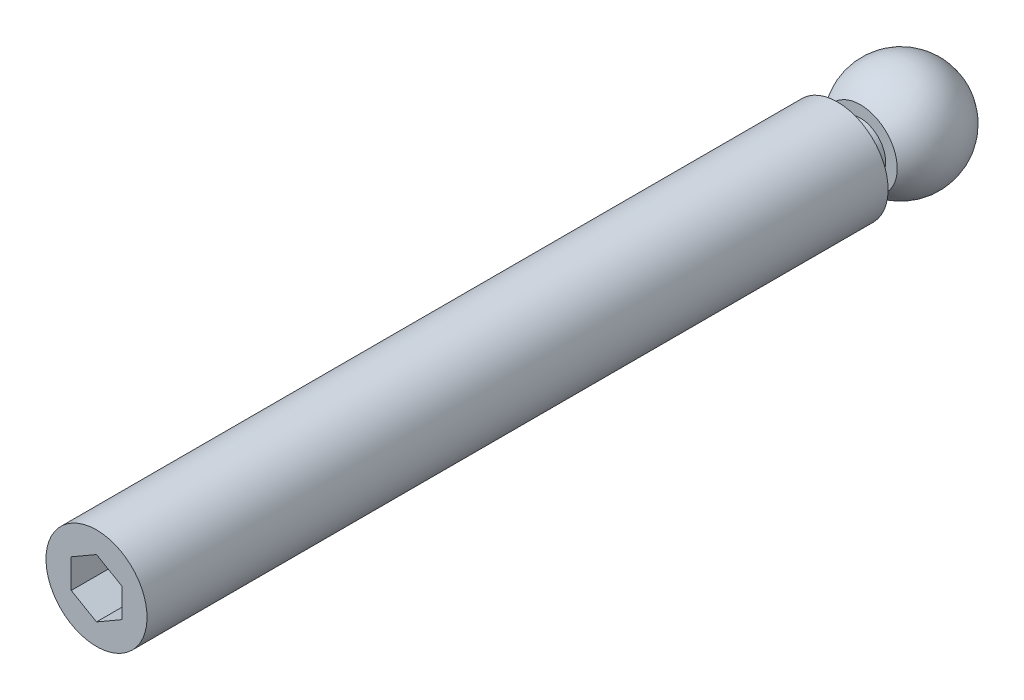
ISO-10303-21;
HEADER;
FILE_DESCRIPTION(('STEP AP214'),'2;1');
FILE_NAME('part.step','',(''),(''),'','','');
FILE_SCHEMA(('AUTOMOTIVE_DESIGN { 1 0 10303 214 1 1 1 1 }'));
ENDSEC;
DATA;
#1=APPLICATION_CONTEXT('core data for automotive mechanical design processes');
#2=APPLICATION_PROTOCOL_DEFINITION('international standard','automotive_design',2000,#1);
#3=PRODUCT_CONTEXT('',#1,'mechanical');
#4=PRODUCT('Part','Part','',(#3));
#5=PRODUCT_RELATED_PRODUCT_CATEGORY('part','',(#4));
#6=PRODUCT_DEFINITION_FORMATION('','',#4);
#7=PRODUCT_DEFINITION_CONTEXT('part definition',#1,'design');
#8=PRODUCT_DEFINITION('design','',#6,#7);
#9=PRODUCT_DEFINITION_SHAPE('','',#8);
#10=(LENGTH_UNIT() NAMED_UNIT(*) SI_UNIT(.MILLI.,.METRE.));
#11=(NAMED_UNIT(*) PLANE_ANGLE_UNIT() SI_UNIT($,.RADIAN.));
#12=(NAMED_UNIT(*) SI_UNIT($,.STERADIAN.) SOLID_ANGLE_UNIT());
#13=UNCERTAINTY_MEASURE_WITH_UNIT(LENGTH_MEASURE(1.E-05),#10,'distance_accuracy_value','');
#14=(GEOMETRIC_REPRESENTATION_CONTEXT(3) GLOBAL_UNCERTAINTY_ASSIGNED_CONTEXT((#13)) GLOBAL_UNIT_ASSIGNED_CONTEXT((#10,
#11,#12)) REPRESENTATION_CONTEXT('',''));
#15=CARTESIAN_POINT('',(0.,0.,0.));
#16=DIRECTION('',(0.,0.,1.));
#17=DIRECTION('',(1.,0.,0.));
#18=AXIS2_PLACEMENT_3D('',#15,#16,#17);
#19=CARTESIAN_POINT('',(0.,0.,6.5));
#20=DIRECTION('',(0.,-1.,0.));
#21=DIRECTION('',(-1.,0.,0.));
#22=AXIS2_PLACEMENT_3D('',#19,#20,#21);
#23=SPHERICAL_SURFACE('',#22,6.5);
#24=CARTESIAN_POINT('',(0.,0.,6.5));
#25=DIRECTION('',(0.,0.,1.));
#26=DIRECTION('',(0.,1.,0.));
#27=AXIS2_PLACEMENT_3D('',#24,#25,#26);
#28=SPHERICAL_SURFACE('',#27,6.5);
#29=CARTESIAN_POINT('',(0.,0.,11.3));
#30=DIRECTION('',(0.,0.,1.));
#31=DIRECTION('',(0.,1.,0.));
#32=AXIS2_PLACEMENT_3D('',#29,#30,#31);
#33=CIRCLE('',#32,4.38292140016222);
#34=CARTESIAN_POINT('',(0.,4.38292140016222,11.3));
#35=VERTEX_POINT('',#34);
#36=EDGE_CURVE('E9',#35,#35,#33,.T.);
#37=ORIENTED_EDGE('',*,*,#36,.F.);
#38=EDGE_LOOP('',(#37));
#39=FACE_BOUND('',#38,.T.);
#40=ADVANCED_FACE('F14',(#39),#28,.T.);
#41=CARTESIAN_POINT('',(0.,-4.38292140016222,11.3));
#42=DIRECTION('',(0.,0.,-1.));
#43=DIRECTION('',(0.,-1.,0.));
#44=AXIS2_PLACEMENT_3D('',#41,#42,#43);
#45=PLANE('',#44);
#46=CARTESIAN_POINT('',(0.,0.,11.3));
#47=DIRECTION('',(0.,0.,1.));
#48=DIRECTION('',(0.,1.,0.));
#49=AXIS2_PLACEMENT_3D('',#46,#47,#48);
#50=CIRCLE('',#49,3.);
#51=CARTESIAN_POINT('',(0.,3.,11.3));
#52=VERTEX_POINT('',#51);
#53=EDGE_CURVE('E21',#52,#52,#50,.T.);
#54=ORIENTED_EDGE('',*,*,#53,.F.);
#55=EDGE_LOOP('',(#54));
#56=FACE_BOUND('',#55,.T.);
#57=ORIENTED_EDGE('',*,*,#36,.T.);
#58=EDGE_LOOP('',(#57));
#59=FACE_BOUND('',#58,.T.);
#60=ADVANCED_FACE('F134',(#56,#59),#45,.F.);
#61=CARTESIAN_POINT('',(0.,0.,8.3));
#62=DIRECTION('',(0.,0.,1.));
#63=DIRECTION('',(0.,1.,0.));
#64=AXIS2_PLACEMENT_3D('',#61,#62,#63);
#65=CYLINDRICAL_SURFACE('',#64,3.);
#66=ORIENTED_EDGE('',*,*,#53,.T.);
#67=EDGE_LOOP('',(#66));
#68=FACE_BOUND('',#67,.T.);
#69=CARTESIAN_POINT('',(0.,0.,14.));
#70=DIRECTION('',(0.,0.,1.));
#71=DIRECTION('',(0.,1.,0.));
#72=AXIS2_PLACEMENT_3D('',#69,#70,#71);
#73=CIRCLE('',#72,3.);
#74=CARTESIAN_POINT('',(0.,3.,14.));
#75=VERTEX_POINT('',#74);
#76=EDGE_CURVE('E126',#75,#75,#73,.T.);
#77=ORIENTED_EDGE('',*,*,#76,.F.);
#78=EDGE_LOOP('',(#77));
#79=FACE_BOUND('',#78,.T.);
#80=ADVANCED_FACE('F131',(#68,#79),#65,.T.);
#81=CARTESIAN_POINT('',(0.,-6.,14.));
#82=DIRECTION('',(0.,0.,-1.));
#83=DIRECTION('',(0.,-1.,0.));
#84=AXIS2_PLACEMENT_3D('',#81,#82,#83);
#85=PLANE('',#84);
#86=ORIENTED_EDGE('',*,*,#76,.T.);
#87=EDGE_LOOP('',(#86));
#88=FACE_BOUND('',#87,.T.);
#89=CARTESIAN_POINT('',(0.,0.,14.));
#90=DIRECTION('',(0.,0.,1.));
#91=DIRECTION('',(0.,1.,0.));
#92=AXIS2_PLACEMENT_3D('',#89,#90,#91);
#93=CIRCLE('',#92,6.);
#94=CARTESIAN_POINT('',(0.,6.,14.));
#95=VERTEX_POINT('',#94);
#96=EDGE_CURVE('E123',#95,#95,#93,.T.);
#97=ORIENTED_EDGE('',*,*,#96,.F.);
#98=EDGE_LOOP('',(#97));
#99=FACE_BOUND('',#98,.T.);
#100=ADVANCED_FACE('F157',(#88,#99),#85,.T.);
#101=CARTESIAN_POINT('',(0.,0.,8.3));
#102=DIRECTION('',(0.,0.,1.));
#103=DIRECTION('',(0.,1.,0.));
#104=AXIS2_PLACEMENT_3D('',#101,#102,#103);
#105=CYLINDRICAL_SURFACE('',#104,6.);
#106=ORIENTED_EDGE('',*,*,#96,.T.);
#107=EDGE_LOOP('',(#106));
#108=FACE_BOUND('',#107,.T.);
#109=CARTESIAN_POINT('',(0.,0.,102.));
#110=DIRECTION('',(0.,0.,1.));
#111=DIRECTION('',(0.,1.,0.));
#112=AXIS2_PLACEMENT_3D('',#109,#110,#111);
#113=CIRCLE('',#112,6.);
#114=CARTESIAN_POINT('',(0.,6.,102.));
#115=VERTEX_POINT('',#114);
#116=EDGE_CURVE('E115',#115,#115,#113,.T.);
#117=ORIENTED_EDGE('',*,*,#116,.F.);
#118=EDGE_LOOP('',(#117));
#119=FACE_BOUND('',#118,.T.);
#120=ADVANCED_FACE('F165',(#108,#119),#105,.T.);
#121=CARTESIAN_POINT('',(0.,0.,102.));
#122=DIRECTION('',(0.,0.,1.));
#123=DIRECTION('',(0.,1.,0.));
#124=AXIS2_PLACEMENT_3D('',#121,#122,#123);
#125=PLANE('',#124);
#126=DIRECTION('',(-0.866025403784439,0.5,0.));
#127=VECTOR('',#126,1.);
#128=CARTESIAN_POINT('',(3.,1.73205080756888,102.));
#129=LINE('',#128,#127);
#130=CARTESIAN_POINT('',(3.,1.73205080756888,102.));
#131=VERTEX_POINT('',#130);
#132=CARTESIAN_POINT('',(0.,3.46410161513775,102.));
#133=VERTEX_POINT('',#132);
#134=EDGE_CURVE('E28',#131,#133,#129,.T.);
#135=ORIENTED_EDGE('',*,*,#134,.F.);
#136=DIRECTION('',(0.,1.,0.));
#137=VECTOR('',#136,1.);
#138=CARTESIAN_POINT('',(3.,-1.73205080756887,102.));
#139=LINE('',#138,#137);
#140=CARTESIAN_POINT('',(3.,-1.73205080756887,102.));
#141=VERTEX_POINT('',#140);
#142=EDGE_CURVE('E111',#141,#131,#139,.T.);
#143=ORIENTED_EDGE('',*,*,#142,.F.);
#144=DIRECTION('',(0.866025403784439,0.5,0.));
#145=VECTOR('',#144,1.);
#146=CARTESIAN_POINT('',(0.,-3.46410161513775,102.));
#147=LINE('',#146,#145);
#148=CARTESIAN_POINT('',(0.,-3.46410161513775,102.));
#149=VERTEX_POINT('',#148);
#150=EDGE_CURVE('E109',#149,#141,#147,.T.);
#151=ORIENTED_EDGE('',*,*,#150,.F.);
#152=DIRECTION('',(0.866025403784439,-0.5,0.));
#153=VECTOR('',#152,1.);
#154=CARTESIAN_POINT('',(-3.,-1.73205080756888,102.));
#155=LINE('',#154,#153);
#156=CARTESIAN_POINT('',(-3.,-1.73205080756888,102.));
#157=VERTEX_POINT('',#156);
#158=EDGE_CURVE('E76',#157,#149,#155,.T.);
#159=ORIENTED_EDGE('',*,*,#158,.F.);
#160=DIRECTION('',(0.,-1.,0.));
#161=VECTOR('',#160,1.);
#162=CARTESIAN_POINT('',(-3.,1.73205080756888,102.));
#163=LINE('',#162,#161);
#164=CARTESIAN_POINT('',(-3.,1.73205080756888,102.));
#165=VERTEX_POINT('',#164);
#166=EDGE_CURVE('E105',#165,#157,#163,.T.);
#167=ORIENTED_EDGE('',*,*,#166,.F.);
#168=DIRECTION('',(-0.866025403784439,-0.5,0.));
#169=VECTOR('',#168,1.);
#170=CARTESIAN_POINT('',(0.,3.46410161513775,102.));
#171=LINE('',#170,#169);
#172=EDGE_CURVE('E102',#133,#165,#171,.T.);
#173=ORIENTED_EDGE('',*,*,#172,.F.);
#174=EDGE_LOOP('',(#135,#143,#151,#159,#167,#173));
#175=FACE_BOUND('',#174,.T.);
#176=ORIENTED_EDGE('',*,*,#116,.T.);
#177=EDGE_LOOP('',(#176));
#178=FACE_BOUND('',#177,.T.);
#179=ADVANCED_FACE('F174',(#175,#178),#125,.T.);
#180=CARTESIAN_POINT('',(3.,1.73205080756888,94.));
#181=DIRECTION('',(0.5,0.866025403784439,0.));
#182=DIRECTION('',(-0.866025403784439,0.5,0.));
#183=AXIS2_PLACEMENT_3D('',#180,#181,#182);
#184=PLANE('',#183);
#185=ORIENTED_EDGE('',*,*,#134,.T.);
#186=DIRECTION('',(0.,0.,1.));
#187=VECTOR('',#186,1.);
#188=CARTESIAN_POINT('',(0.,3.46410161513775,94.));
#189=LINE('',#188,#187);
#190=CARTESIAN_POINT('',(0.,3.46410161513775,94.));
#191=VERTEX_POINT('',#190);
#192=EDGE_CURVE('E58',#191,#133,#189,.T.);
#193=ORIENTED_EDGE('',*,*,#192,.F.);
#194=DIRECTION('',(-0.866025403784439,0.5,0.));
#195=VECTOR('',#194,1.);
#196=CARTESIAN_POINT('',(3.,1.73205080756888,94.));
#197=LINE('',#196,#195);
#198=CARTESIAN_POINT('',(3.,1.73205080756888,94.));
#199=VERTEX_POINT('',#198);
#200=EDGE_CURVE('E113',#199,#191,#197,.T.);
#201=ORIENTED_EDGE('',*,*,#200,.F.);
#202=DIRECTION('',(0.,0.,1.));
#203=VECTOR('',#202,1.);
#204=CARTESIAN_POINT('',(3.,1.73205080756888,94.));
#205=LINE('',#204,#203);
#206=EDGE_CURVE('E36',#199,#131,#205,.T.);
#207=ORIENTED_EDGE('',*,*,#206,.T.);
#208=EDGE_LOOP('',(#185,#193,#201,#207));
#209=FACE_BOUND('',#208,.T.);
#210=ADVANCED_FACE('F183',(#209),#184,.F.);
#211=CARTESIAN_POINT('',(3.,-1.73205080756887,94.));
#212=DIRECTION('',(1.,0.,0.));
#213=DIRECTION('',(0.,1.,0.));
#214=AXIS2_PLACEMENT_3D('',#211,#212,#213);
#215=PLANE('',#214);
#216=ORIENTED_EDGE('',*,*,#142,.T.);
#217=ORIENTED_EDGE('',*,*,#206,.F.);
#218=DIRECTION('',(0.,1.,0.));
#219=VECTOR('',#218,1.);
#220=CARTESIAN_POINT('',(3.,-1.73205080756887,94.));
#221=LINE('',#220,#219);
#222=CARTESIAN_POINT('',(3.,-1.73205080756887,94.));
#223=VERTEX_POINT('',#222);
#224=EDGE_CURVE('E88',#223,#199,#221,.T.);
#225=ORIENTED_EDGE('',*,*,#224,.F.);
#226=DIRECTION('',(0.,0.,1.));
#227=VECTOR('',#226,1.);
#228=CARTESIAN_POINT('',(3.,-1.73205080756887,94.));
#229=LINE('',#228,#227);
#230=EDGE_CURVE('E80',#223,#141,#229,.T.);
#231=ORIENTED_EDGE('',*,*,#230,.T.);
#232=EDGE_LOOP('',(#216,#217,#225,#231));
#233=FACE_BOUND('',#232,.T.);
#234=ADVANCED_FACE('F192',(#233),#215,.F.);
#235=CARTESIAN_POINT('',(0.,-3.46410161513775,94.));
#236=DIRECTION('',(0.5,-0.866025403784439,0.));
#237=DIRECTION('',(0.866025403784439,0.5,0.));
#238=AXIS2_PLACEMENT_3D('',#235,#236,#237);
#239=PLANE('',#238);
#240=ORIENTED_EDGE('',*,*,#150,.T.);
#241=ORIENTED_EDGE('',*,*,#230,.F.);
#242=DIRECTION('',(0.866025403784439,0.5,0.));
#243=VECTOR('',#242,1.);
#244=CARTESIAN_POINT('',(0.,-3.46410161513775,94.));
#245=LINE('',#244,#243);
#246=CARTESIAN_POINT('',(0.,-3.46410161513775,94.));
#247=VERTEX_POINT('',#246);
#248=EDGE_CURVE('E84',#247,#223,#245,.T.);
#249=ORIENTED_EDGE('',*,*,#248,.F.);
#250=DIRECTION('',(0.,0.,1.));
#251=VECTOR('',#250,1.);
#252=CARTESIAN_POINT('',(0.,-3.46410161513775,94.));
#253=LINE('',#252,#251);
#254=EDGE_CURVE('E69',#247,#149,#253,.T.);
#255=ORIENTED_EDGE('',*,*,#254,.T.);
#256=EDGE_LOOP('',(#240,#241,#249,#255));
#257=FACE_BOUND('',#256,.T.);
#258=ADVANCED_FACE('F85',(#257),#239,.F.);
#259=CARTESIAN_POINT('',(-3.,-1.73205080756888,94.));
#260=DIRECTION('',(-0.5,-0.866025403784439,0.));
#261=DIRECTION('',(0.866025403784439,-0.5,0.));
#262=AXIS2_PLACEMENT_3D('',#259,#260,#261);
#263=PLANE('',#262);
#264=ORIENTED_EDGE('',*,*,#158,.T.);
#265=ORIENTED_EDGE('',*,*,#254,.F.);
#266=DIRECTION('',(0.866025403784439,-0.5,0.));
#267=VECTOR('',#266,1.);
#268=CARTESIAN_POINT('',(-3.,-1.73205080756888,94.));
#269=LINE('',#268,#267);
#270=CARTESIAN_POINT('',(-3.,-1.73205080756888,94.));
#271=VERTEX_POINT('',#270);
#272=EDGE_CURVE('E73',#271,#247,#269,.T.);
#273=ORIENTED_EDGE('',*,*,#272,.F.);
#274=DIRECTION('',(0.,0.,1.));
#275=VECTOR('',#274,1.);
#276=CARTESIAN_POINT('',(-3.,-1.73205080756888,94.));
#277=LINE('',#276,#275);
#278=EDGE_CURVE('E81',#271,#157,#277,.T.);
#279=ORIENTED_EDGE('',*,*,#278,.T.);
#280=EDGE_LOOP('',(#264,#265,#273,#279));
#281=FACE_BOUND('',#280,.T.);
#282=ADVANCED_FACE('F71',(#281),#263,.F.);
#283=CARTESIAN_POINT('',(-3.,1.73205080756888,94.));
#284=DIRECTION('',(-1.,0.,0.));
#285=DIRECTION('',(0.,-1.,0.));
#286=AXIS2_PLACEMENT_3D('',#283,#284,#285);
#287=PLANE('',#286);
#288=ORIENTED_EDGE('',*,*,#166,.T.);
#289=ORIENTED_EDGE('',*,*,#278,.F.);
#290=DIRECTION('',(0.,-1.,0.));
#291=VECTOR('',#290,1.);
#292=CARTESIAN_POINT('',(-3.,1.73205080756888,94.));
#293=LINE('',#292,#291);
#294=CARTESIAN_POINT('',(-3.,1.73205080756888,94.));
#295=VERTEX_POINT('',#294);
#296=EDGE_CURVE('E94',#295,#271,#293,.T.);
#297=ORIENTED_EDGE('',*,*,#296,.F.);
#298=DIRECTION('',(0.,0.,1.));
#299=VECTOR('',#298,1.);
#300=CARTESIAN_POINT('',(-3.,1.73205080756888,94.));
#301=LINE('',#300,#299);
#302=EDGE_CURVE('E118',#295,#165,#301,.T.);
#303=ORIENTED_EDGE('',*,*,#302,.T.);
#304=EDGE_LOOP('',(#288,#289,#297,#303));
#305=FACE_BOUND('',#304,.T.);
#306=ADVANCED_FACE('F214',(#305),#287,.F.);
#307=CARTESIAN_POINT('',(0.,3.46410161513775,94.));
#308=DIRECTION('',(-0.5,0.866025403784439,0.));
#309=DIRECTION('',(-0.866025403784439,-0.5,0.));
#310=AXIS2_PLACEMENT_3D('',#307,#308,#309);
#311=PLANE('',#310);
#312=ORIENTED_EDGE('',*,*,#172,.T.);
#313=ORIENTED_EDGE('',*,*,#302,.F.);
#314=DIRECTION('',(-0.866025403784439,-0.5,0.));
#315=VECTOR('',#314,1.);
#316=CARTESIAN_POINT('',(0.,3.46410161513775,94.));
#317=LINE('',#316,#315);
#318=EDGE_CURVE('E96',#191,#295,#317,.T.);
#319=ORIENTED_EDGE('',*,*,#318,.F.);
#320=ORIENTED_EDGE('',*,*,#192,.T.);
#321=EDGE_LOOP('',(#312,#313,#319,#320));
#322=FACE_BOUND('',#321,.T.);
#323=ADVANCED_FACE('F222',(#322),#311,.F.);
#324=CARTESIAN_POINT('',(0.,3.46410161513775,94.));
#325=DIRECTION('',(0.,0.,1.));
#326=DIRECTION('',(1.,0.,0.));
#327=AXIS2_PLACEMENT_3D('',#324,#325,#326);
#328=PLANE('',#327);
#329=ORIENTED_EDGE('',*,*,#200,.T.);
#330=ORIENTED_EDGE('',*,*,#318,.T.);
#331=ORIENTED_EDGE('',*,*,#296,.T.);
#332=ORIENTED_EDGE('',*,*,#272,.T.);
#333=ORIENTED_EDGE('',*,*,#248,.T.);
#334=ORIENTED_EDGE('',*,*,#224,.T.);
#335=EDGE_LOOP('',(#329,#330,#331,#332,#333,#334));
#336=FACE_BOUND('',#335,.T.);
#337=ADVANCED_FACE('F91',(#336),#328,.T.);
#338=CLOSED_SHELL('',(#40,#60,#80,#100,#120,#179,#210,#234,#258,#282,#306,#323,#337));
#339=MANIFOLD_SOLID_BREP('B1',#338);
#340=ADVANCED_BREP_SHAPE_REPRESENTATION('',(#18,#339),#14);
#341=SHAPE_DEFINITION_REPRESENTATION(#9,#340);
ENDSEC;
END-ISO-10303-21;
